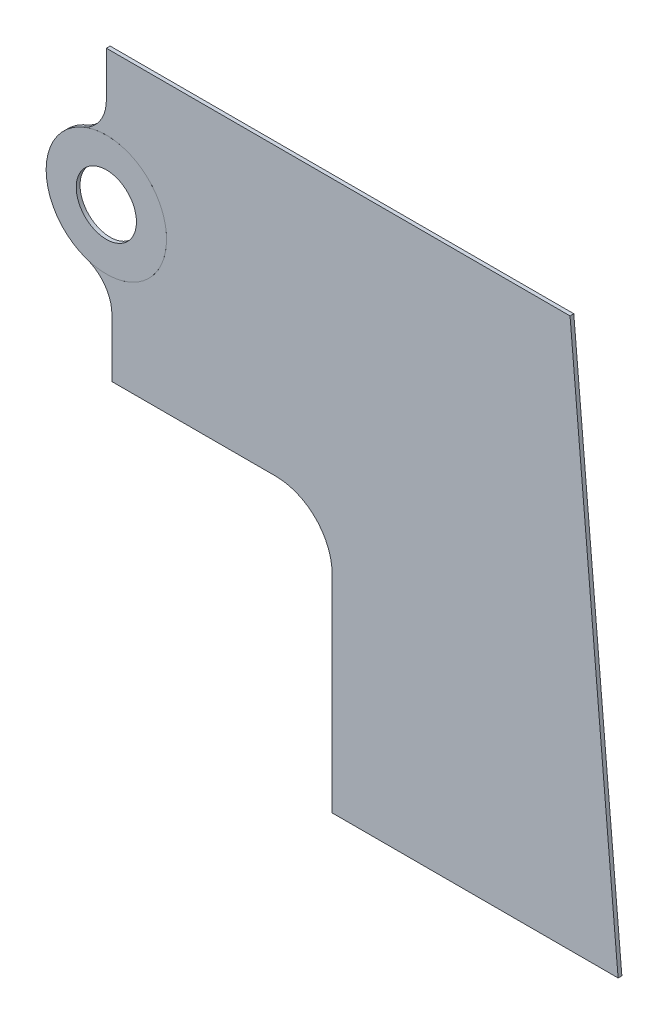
ISO-10303-21;
HEADER;
FILE_DESCRIPTION(('STEP AP214'),'2;1');
FILE_NAME('part.step','',(''),(''),'','','');
FILE_SCHEMA(('AUTOMOTIVE_DESIGN { 1 0 10303 214 1 1 1 1 }'));
ENDSEC;
DATA;
#1=APPLICATION_CONTEXT('core data for automotive mechanical design processes');
#2=APPLICATION_PROTOCOL_DEFINITION('international standard','automotive_design',2000,#1);
#3=PRODUCT_CONTEXT('',#1,'mechanical');
#4=PRODUCT('Part','Part','',(#3));
#5=PRODUCT_RELATED_PRODUCT_CATEGORY('part','',(#4));
#6=PRODUCT_DEFINITION_FORMATION('','',#4);
#7=PRODUCT_DEFINITION_CONTEXT('part definition',#1,'design');
#8=PRODUCT_DEFINITION('design','',#6,#7);
#9=PRODUCT_DEFINITION_SHAPE('','',#8);
#10=(LENGTH_UNIT() NAMED_UNIT(*) SI_UNIT(.MILLI.,.METRE.));
#11=(NAMED_UNIT(*) PLANE_ANGLE_UNIT() SI_UNIT($,.RADIAN.));
#12=(NAMED_UNIT(*) SI_UNIT($,.STERADIAN.) SOLID_ANGLE_UNIT());
#13=UNCERTAINTY_MEASURE_WITH_UNIT(LENGTH_MEASURE(1.E-05),#10,'distance_accuracy_value','');
#14=(GEOMETRIC_REPRESENTATION_CONTEXT(3) GLOBAL_UNCERTAINTY_ASSIGNED_CONTEXT((#13)) GLOBAL_UNIT_ASSIGNED_CONTEXT((#10,
#11,#12)) REPRESENTATION_CONTEXT('',''));
#15=CARTESIAN_POINT('',(0.,0.,0.));
#16=DIRECTION('',(0.,0.,1.));
#17=DIRECTION('',(1.,0.,0.));
#18=AXIS2_PLACEMENT_3D('',#15,#16,#17);
#19=CARTESIAN_POINT('',(-60.,109.995097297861,-0.01));
#20=DIRECTION('',(0.,0.,1.));
#21=DIRECTION('',(1.,0.,0.));
#22=AXIS2_PLACEMENT_3D('',#19,#20,#21);
#23=CYLINDRICAL_SURFACE('',#22,16.);
#24=CARTESIAN_POINT('',(-60.,109.995097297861,0.));
#25=DIRECTION('',(0.,0.,1.));
#26=DIRECTION('',(-1.,0.,0.));
#27=AXIS2_PLACEMENT_3D('',#24,#25,#26);
#28=CIRCLE('',#27,16.);
#29=CARTESIAN_POINT('',(-76.,109.995097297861,0.));
#30=VERTEX_POINT('',#29);
#31=EDGE_CURVE('E63',#30,#30,#28,.T.);
#32=ORIENTED_EDGE('',*,*,#31,.T.);
#33=EDGE_LOOP('',(#32));
#34=FACE_BOUND('',#33,.T.);
#35=CARTESIAN_POINT('',(-60.,109.995097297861,1.));
#36=DIRECTION('',(0.,0.,1.));
#37=DIRECTION('',(-1.,0.,0.));
#38=AXIS2_PLACEMENT_3D('',#35,#36,#37);
#39=CIRCLE('',#38,16.);
#40=CARTESIAN_POINT('',(-76.,109.995097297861,1.));
#41=VERTEX_POINT('',#40);
#42=EDGE_CURVE('E65',#41,#41,#39,.T.);
#43=ORIENTED_EDGE('',*,*,#42,.F.);
#44=EDGE_LOOP('',(#43));
#45=FACE_BOUND('',#44,.T.);
#46=ADVANCED_FACE('F52',(#34,#45),#23,.T.);
#47=CARTESIAN_POINT('',(-15.,55.,1.));
#48=DIRECTION('',(0.,0.,-1.));
#49=DIRECTION('',(-1.,0.,0.));
#50=AXIS2_PLACEMENT_3D('',#47,#48,#49);
#51=PLANE('',#50);
#52=CARTESIAN_POINT('',(-60.,109.995097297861,1.));
#53=DIRECTION('',(0.,0.,1.));
#54=DIRECTION('',(1.,0.,0.));
#55=AXIS2_PLACEMENT_3D('',#52,#53,#54);
#56=CIRCLE('',#55,8.);
#57=CARTESIAN_POINT('',(-52.,109.995097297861,1.));
#58=VERTEX_POINT('',#57);
#59=EDGE_CURVE('E56',#58,#58,#56,.T.);
#60=ORIENTED_EDGE('',*,*,#59,.F.);
#61=EDGE_LOOP('',(#60));
#62=FACE_BOUND('',#61,.T.);
#63=ORIENTED_EDGE('',*,*,#42,.T.);
#64=EDGE_LOOP('',(#63));
#65=FACE_BOUND('',#64,.T.);
#66=ADVANCED_FACE('F75',(#62,#65),#51,.F.);
#67=CARTESIAN_POINT('',(-15.,55.,0.));
#68=DIRECTION('',(0.,0.,-1.));
#69=DIRECTION('',(-1.,0.,0.));
#70=AXIS2_PLACEMENT_3D('',#67,#68,#69);
#71=PLANE('',#70);
#72=CARTESIAN_POINT('',(-60.,109.995097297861,0.));
#73=DIRECTION('',(0.,0.,1.));
#74=DIRECTION('',(1.,0.,0.));
#75=AXIS2_PLACEMENT_3D('',#72,#73,#74);
#76=CIRCLE('',#75,8.);
#77=CARTESIAN_POINT('',(-52.,109.995097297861,0.));
#78=VERTEX_POINT('',#77);
#79=EDGE_CURVE('E11',#78,#78,#76,.T.);
#80=ORIENTED_EDGE('',*,*,#79,.T.);
#81=EDGE_LOOP('',(#80));
#82=FACE_BOUND('',#81,.T.);
#83=ORIENTED_EDGE('',*,*,#31,.F.);
#84=EDGE_LOOP('',(#83));
#85=FACE_BOUND('',#84,.T.);
#86=ADVANCED_FACE('F54',(#82,#85),#71,.T.);
#87=CARTESIAN_POINT('',(-60.,109.995097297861,1.));
#88=DIRECTION('',(0.,0.,-1.));
#89=DIRECTION('',(-1.,0.,0.));
#90=AXIS2_PLACEMENT_3D('',#87,#88,#89);
#91=CYLINDRICAL_SURFACE('',#90,8.);
#92=ORIENTED_EDGE('',*,*,#59,.T.);
#93=EDGE_LOOP('',(#92));
#94=FACE_BOUND('',#93,.T.);
#95=ORIENTED_EDGE('',*,*,#79,.F.);
#96=EDGE_LOOP('',(#95));
#97=FACE_BOUND('',#96,.T.);
#98=ADVANCED_FACE('F74',(#94,#97),#91,.F.);
#99=CLOSED_SHELL('',(#46,#66,#86,#98));
#100=MANIFOLD_SOLID_BREP('B2',#99);
#101=CARTESIAN_POINT('',(-60.,109.995097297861,-0.01));
#102=DIRECTION('',(0.,0.,1.));
#103=DIRECTION('',(1.,0.,0.));
#104=AXIS2_PLACEMENT_3D('',#101,#102,#103);
#105=CYLINDRICAL_SURFACE('',#104,16.);
#106=CARTESIAN_POINT('',(-60.,109.995097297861,0.));
#107=DIRECTION('',(0.,0.,-1.));
#108=DIRECTION('',(-1.,0.,0.));
#109=AXIS2_PLACEMENT_3D('',#106,#107,#108);
#110=CIRCLE('',#109,16.);
#111=CARTESIAN_POINT('',(-66.1538461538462,124.764328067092,0.));
#112=VERTEX_POINT('',#111);
#113=CARTESIAN_POINT('',(-65.2447067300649,94.8791106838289,0.));
#114=VERTEX_POINT('',#113);
#115=EDGE_CURVE('E121',#112,#114,#110,.T.);
#116=ORIENTED_EDGE('',*,*,#115,.T.);
#117=DIRECTION('',(0.,0.,-1.));
#118=VECTOR('',#117,1.);
#119=CARTESIAN_POINT('',(-65.2447067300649,94.8791106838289,1.));
#120=LINE('',#119,#118);
#121=CARTESIAN_POINT('',(-65.2447067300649,94.8791106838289,1.));
#122=VERTEX_POINT('',#121);
#123=EDGE_CURVE('E234',#122,#114,#120,.T.);
#124=ORIENTED_EDGE('',*,*,#123,.F.);
#125=CARTESIAN_POINT('',(-60.,109.995097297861,1.));
#126=DIRECTION('',(0.,0.,-1.));
#127=DIRECTION('',(-1.,0.,0.));
#128=AXIS2_PLACEMENT_3D('',#125,#126,#127);
#129=CIRCLE('',#128,16.);
#130=CARTESIAN_POINT('',(-66.1538461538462,124.764328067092,1.));
#131=VERTEX_POINT('',#130);
#132=EDGE_CURVE('E225',#131,#122,#129,.T.);
#133=ORIENTED_EDGE('',*,*,#132,.F.);
#134=DIRECTION('',(0.,0.,-1.));
#135=VECTOR('',#134,1.);
#136=CARTESIAN_POINT('',(-66.1538461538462,124.764328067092,1.));
#137=LINE('',#136,#135);
#138=EDGE_CURVE('E50',#131,#112,#137,.T.);
#139=ORIENTED_EDGE('',*,*,#138,.T.);
#140=EDGE_LOOP('',(#116,#124,#133,#139));
#141=FACE_BOUND('',#140,.T.);
#142=ADVANCED_FACE('F118',(#141),#105,.F.);
#143=CARTESIAN_POINT('',(-58.5226484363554,70.,1.));
#144=DIRECTION('',(0.,1.,0.));
#145=DIRECTION('',(0.,0.,1.));
#146=AXIS2_PLACEMENT_3D('',#143,#144,#145);
#147=PLANE('',#146);
#148=DIRECTION('',(1.,0.,0.));
#149=VECTOR('',#148,1.);
#150=CARTESIAN_POINT('',(-58.5226484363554,70.,0.));
#151=LINE('',#150,#149);
#152=CARTESIAN_POINT('',(-58.5226484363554,70.,0.));
#153=VERTEX_POINT('',#152);
#154=CARTESIAN_POINT('',(-15.,70.,0.));
#155=VERTEX_POINT('',#154);
#156=EDGE_CURVE('E254',#153,#155,#151,.T.);
#157=ORIENTED_EDGE('',*,*,#156,.T.);
#158=DIRECTION('',(0.,0.,-1.));
#159=VECTOR('',#158,1.);
#160=CARTESIAN_POINT('',(-15.,70.,1.));
#161=LINE('',#160,#159);
#162=CARTESIAN_POINT('',(-15.,70.,1.));
#163=VERTEX_POINT('',#162);
#164=EDGE_CURVE('E243',#163,#155,#161,.T.);
#165=ORIENTED_EDGE('',*,*,#164,.F.);
#166=DIRECTION('',(1.,0.,0.));
#167=VECTOR('',#166,1.);
#168=CARTESIAN_POINT('',(-58.5226484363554,70.,1.));
#169=LINE('',#168,#167);
#170=CARTESIAN_POINT('',(-58.5226484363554,70.,1.));
#171=VERTEX_POINT('',#170);
#172=EDGE_CURVE('E273',#171,#163,#169,.T.);
#173=ORIENTED_EDGE('',*,*,#172,.F.);
#174=DIRECTION('',(0.,0.,-1.));
#175=VECTOR('',#174,1.);
#176=CARTESIAN_POINT('',(-58.5226484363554,70.,1.));
#177=LINE('',#176,#175);
#178=EDGE_CURVE('E240',#171,#153,#177,.T.);
#179=ORIENTED_EDGE('',*,*,#178,.T.);
#180=EDGE_LOOP('',(#157,#165,#173,#179));
#181=FACE_BOUND('',#180,.T.);
#182=ADVANCED_FACE('F312',(#181),#147,.F.);
#183=CARTESIAN_POINT('',(-15.,55.,1.));
#184=DIRECTION('',(0.,0.,-1.));
#185=DIRECTION('',(-1.,0.,0.));
#186=AXIS2_PLACEMENT_3D('',#183,#184,#185);
#187=CYLINDRICAL_SURFACE('',#186,15.);
#188=CARTESIAN_POINT('',(-15.,55.,0.));
#189=DIRECTION('',(0.,0.,-1.));
#190=DIRECTION('',(-1.,0.,0.));
#191=AXIS2_PLACEMENT_3D('',#188,#189,#190);
#192=CIRCLE('',#191,15.);
#193=CARTESIAN_POINT('',(0.,55.,0.));
#194=VERTEX_POINT('',#193);
#195=EDGE_CURVE('E252',#155,#194,#192,.T.);
#196=ORIENTED_EDGE('',*,*,#195,.T.);
#197=DIRECTION('',(0.,0.,-1.));
#198=VECTOR('',#197,1.);
#199=CARTESIAN_POINT('',(0.,55.,1.));
#200=LINE('',#199,#198);
#201=CARTESIAN_POINT('',(0.,55.,1.));
#202=VERTEX_POINT('',#201);
#203=EDGE_CURVE('E246',#202,#194,#200,.T.);
#204=ORIENTED_EDGE('',*,*,#203,.F.);
#205=CARTESIAN_POINT('',(-15.,55.,1.));
#206=DIRECTION('',(0.,0.,-1.));
#207=DIRECTION('',(-1.,0.,0.));
#208=AXIS2_PLACEMENT_3D('',#205,#206,#207);
#209=CIRCLE('',#208,15.);
#210=EDGE_CURVE('E271',#163,#202,#209,.T.);
#211=ORIENTED_EDGE('',*,*,#210,.F.);
#212=ORIENTED_EDGE('',*,*,#164,.T.);
#213=EDGE_LOOP('',(#196,#204,#211,#212));
#214=FACE_BOUND('',#213,.T.);
#215=ADVANCED_FACE('F316',(#214),#187,.F.);
#216=CARTESIAN_POINT('',(0.,0.,1.));
#217=DIRECTION('',(1.,0.,0.));
#218=DIRECTION('',(0.,0.,-1.));
#219=AXIS2_PLACEMENT_3D('',#216,#217,#218);
#220=PLANE('',#219);
#221=DIRECTION('',(0.,-1.,0.));
#222=VECTOR('',#221,1.);
#223=CARTESIAN_POINT('',(0.,0.,0.));
#224=LINE('',#223,#222);
#225=CARTESIAN_POINT('',(0.,0.,0.));
#226=VERTEX_POINT('',#225);
#227=EDGE_CURVE('E220',#194,#226,#224,.T.);
#228=ORIENTED_EDGE('',*,*,#227,.T.);
#229=DIRECTION('',(0.,0.,-1.));
#230=VECTOR('',#229,1.);
#231=CARTESIAN_POINT('',(0.,0.,1.));
#232=LINE('',#231,#230);
#233=CARTESIAN_POINT('',(0.,0.,1.));
#234=VERTEX_POINT('',#233);
#235=EDGE_CURVE('E249',#234,#226,#232,.T.);
#236=ORIENTED_EDGE('',*,*,#235,.F.);
#237=DIRECTION('',(0.,-1.,0.));
#238=VECTOR('',#237,1.);
#239=CARTESIAN_POINT('',(0.,0.,1.));
#240=LINE('',#239,#238);
#241=EDGE_CURVE('E216',#202,#234,#240,.T.);
#242=ORIENTED_EDGE('',*,*,#241,.F.);
#243=ORIENTED_EDGE('',*,*,#203,.T.);
#244=EDGE_LOOP('',(#228,#236,#242,#243));
#245=FACE_BOUND('',#244,.T.);
#246=ADVANCED_FACE('F319',(#245),#220,.F.);
#247=CARTESIAN_POINT('',(76.,0.,1.));
#248=DIRECTION('',(0.,1.,0.));
#249=DIRECTION('',(-1.,0.,0.));
#250=AXIS2_PLACEMENT_3D('',#247,#248,#249);
#251=PLANE('',#250);
#252=DIRECTION('',(1.,0.,0.));
#253=VECTOR('',#252,1.);
#254=CARTESIAN_POINT('',(76.,0.,0.));
#255=LINE('',#254,#253);
#256=CARTESIAN_POINT('',(76.,0.,0.));
#257=VERTEX_POINT('',#256);
#258=EDGE_CURVE('E224',#226,#257,#255,.T.);
#259=ORIENTED_EDGE('',*,*,#258,.T.);
#260=DIRECTION('',(0.,0.,-1.));
#261=VECTOR('',#260,1.);
#262=CARTESIAN_POINT('',(76.,0.,1.));
#263=LINE('',#262,#261);
#264=CARTESIAN_POINT('',(76.,0.,1.));
#265=VERTEX_POINT('',#264);
#266=EDGE_CURVE('E203',#265,#257,#263,.T.);
#267=ORIENTED_EDGE('',*,*,#266,.F.);
#268=DIRECTION('',(1.,0.,0.));
#269=VECTOR('',#268,1.);
#270=CARTESIAN_POINT('',(76.,0.,1.));
#271=LINE('',#270,#269);
#272=EDGE_CURVE('E210',#234,#265,#271,.T.);
#273=ORIENTED_EDGE('',*,*,#272,.F.);
#274=ORIENTED_EDGE('',*,*,#235,.T.);
#275=EDGE_LOOP('',(#259,#267,#273,#274));
#276=FACE_BOUND('',#275,.T.);
#277=ADVANCED_FACE('F222',(#276),#251,.F.);
#278=CARTESIAN_POINT('',(76.,0.,1.));
#279=DIRECTION('',(-0.996194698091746,-0.087155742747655,0.));
#280=DIRECTION('',(0.087155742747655,-0.996194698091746,0.));
#281=AXIS2_PLACEMENT_3D('',#278,#279,#280);
#282=PLANE('',#281);
#283=DIRECTION('',(-0.087155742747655,0.996194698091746,0.));
#284=VECTOR('',#283,1.);
#285=CARTESIAN_POINT('',(76.,0.,0.));
#286=LINE('',#285,#284);
#287=CARTESIAN_POINT('',(63.2270840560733,145.995097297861,0.));
#288=VERTEX_POINT('',#287);
#289=EDGE_CURVE('E267',#257,#288,#286,.T.);
#290=ORIENTED_EDGE('',*,*,#289,.T.);
#291=DIRECTION('',(0.,0.,-1.));
#292=VECTOR('',#291,1.);
#293=CARTESIAN_POINT('',(63.2270840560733,145.995097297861,1.));
#294=LINE('',#293,#292);
#295=CARTESIAN_POINT('',(63.2270840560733,145.995097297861,1.));
#296=VERTEX_POINT('',#295);
#297=EDGE_CURVE('E206',#296,#288,#294,.T.);
#298=ORIENTED_EDGE('',*,*,#297,.F.);
#299=DIRECTION('',(-0.087155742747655,0.996194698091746,0.));
#300=VECTOR('',#299,1.);
#301=CARTESIAN_POINT('',(76.,0.,1.));
#302=LINE('',#301,#300);
#303=EDGE_CURVE('E199',#265,#296,#302,.T.);
#304=ORIENTED_EDGE('',*,*,#303,.F.);
#305=ORIENTED_EDGE('',*,*,#266,.T.);
#306=EDGE_LOOP('',(#290,#298,#304,#305));
#307=FACE_BOUND('',#306,.T.);
#308=ADVANCED_FACE('F201',(#307),#282,.F.);
#309=CARTESIAN_POINT('',(-60.,145.995097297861,1.));
#310=DIRECTION('',(0.,-1.,0.));
#311=DIRECTION('',(0.,0.,-1.));
#312=AXIS2_PLACEMENT_3D('',#309,#310,#311);
#313=PLANE('',#312);
#314=DIRECTION('',(-1.,0.,0.));
#315=VECTOR('',#314,1.);
#316=CARTESIAN_POINT('',(-60.,145.995097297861,0.));
#317=LINE('',#316,#315);
#318=CARTESIAN_POINT('',(-60.,145.995097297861,0.));
#319=VERTEX_POINT('',#318);
#320=EDGE_CURVE('E264',#288,#319,#317,.T.);
#321=ORIENTED_EDGE('',*,*,#320,.T.);
#322=DIRECTION('',(0.,0.,-1.));
#323=VECTOR('',#322,1.);
#324=CARTESIAN_POINT('',(-60.,145.995097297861,1.));
#325=LINE('',#324,#323);
#326=CARTESIAN_POINT('',(-60.,145.995097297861,1.));
#327=VERTEX_POINT('',#326);
#328=EDGE_CURVE('E227',#327,#319,#325,.T.);
#329=ORIENTED_EDGE('',*,*,#328,.F.);
#330=DIRECTION('',(-1.,0.,0.));
#331=VECTOR('',#330,1.);
#332=CARTESIAN_POINT('',(-60.,145.995097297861,1.));
#333=LINE('',#332,#331);
#334=EDGE_CURVE('E209',#296,#327,#333,.T.);
#335=ORIENTED_EDGE('',*,*,#334,.F.);
#336=ORIENTED_EDGE('',*,*,#297,.T.);
#337=EDGE_LOOP('',(#321,#329,#335,#336));
#338=FACE_BOUND('',#337,.T.);
#339=ADVANCED_FACE('F289',(#338),#313,.F.);
#340=CARTESIAN_POINT('',(-60.,133.995097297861,1.));
#341=DIRECTION('',(1.,0.,0.));
#342=DIRECTION('',(0.,1.,0.));
#343=AXIS2_PLACEMENT_3D('',#340,#341,#342);
#344=PLANE('',#343);
#345=DIRECTION('',(0.,-1.,0.));
#346=VECTOR('',#345,1.);
#347=CARTESIAN_POINT('',(-60.,133.995097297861,0.));
#348=LINE('',#347,#346);
#349=CARTESIAN_POINT('',(-60.,133.995097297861,0.));
#350=VERTEX_POINT('',#349);
#351=EDGE_CURVE('E262',#319,#350,#348,.T.);
#352=ORIENTED_EDGE('',*,*,#351,.T.);
#353=DIRECTION('',(0.,0.,-1.));
#354=VECTOR('',#353,1.);
#355=CARTESIAN_POINT('',(-60.,133.995097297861,1.));
#356=LINE('',#355,#354);
#357=CARTESIAN_POINT('',(-60.,133.995097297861,1.));
#358=VERTEX_POINT('',#357);
#359=EDGE_CURVE('E232',#358,#350,#356,.T.);
#360=ORIENTED_EDGE('',*,*,#359,.F.);
#361=DIRECTION('',(0.,-1.,0.));
#362=VECTOR('',#361,1.);
#363=CARTESIAN_POINT('',(-60.,133.995097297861,1.));
#364=LINE('',#363,#362);
#365=EDGE_CURVE('E282',#327,#358,#364,.T.);
#366=ORIENTED_EDGE('',*,*,#365,.F.);
#367=ORIENTED_EDGE('',*,*,#328,.T.);
#368=EDGE_LOOP('',(#352,#360,#366,#367));
#369=FACE_BOUND('',#368,.T.);
#370=ADVANCED_FACE('F293',(#369),#344,.F.);
#371=CARTESIAN_POINT('',(-15.,55.,1.));
#372=DIRECTION('',(0.,0.,-1.));
#373=DIRECTION('',(-1.,0.,0.));
#374=AXIS2_PLACEMENT_3D('',#371,#372,#373);
#375=PLANE('',#374);
#376=CARTESIAN_POINT('',(-70.,133.995097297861,1.));
#377=DIRECTION('',(0.,0.,-1.));
#378=DIRECTION('',(-1.,0.,0.));
#379=AXIS2_PLACEMENT_3D('',#376,#377,#378);
#380=CIRCLE('',#379,9.99999999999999);
#381=EDGE_CURVE('E280',#358,#131,#380,.T.);
#382=ORIENTED_EDGE('',*,*,#381,.T.);
#383=ORIENTED_EDGE('',*,*,#132,.T.);
#384=CARTESIAN_POINT('',(-68.5226484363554,85.4316190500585,1.));
#385=DIRECTION('',(0.,0.,-1.));
#386=DIRECTION('',(-1.,0.,0.));
#387=AXIS2_PLACEMENT_3D('',#384,#385,#386);
#388=CIRCLE('',#387,9.99999999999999);
#389=CARTESIAN_POINT('',(-58.5226484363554,85.4316190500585,1.));
#390=VERTEX_POINT('',#389);
#391=EDGE_CURVE('E278',#122,#390,#388,.T.);
#392=ORIENTED_EDGE('',*,*,#391,.T.);
#393=DIRECTION('',(0.,-1.,0.));
#394=VECTOR('',#393,1.);
#395=CARTESIAN_POINT('',(-58.5226484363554,85.4316190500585,1.));
#396=LINE('',#395,#394);
#397=EDGE_CURVE('E274',#390,#171,#396,.T.);
#398=ORIENTED_EDGE('',*,*,#397,.T.);
#399=ORIENTED_EDGE('',*,*,#172,.T.);
#400=ORIENTED_EDGE('',*,*,#210,.T.);
#401=ORIENTED_EDGE('',*,*,#241,.T.);
#402=ORIENTED_EDGE('',*,*,#272,.T.);
#403=ORIENTED_EDGE('',*,*,#303,.T.);
#404=ORIENTED_EDGE('',*,*,#334,.T.);
#405=ORIENTED_EDGE('',*,*,#365,.T.);
#406=EDGE_LOOP('',(#382,#383,#392,#398,#399,#400,#401,#402,#403,#404,#405));
#407=FACE_BOUND('',#406,.T.);
#408=ADVANCED_FACE('F214',(#407),#375,.F.);
#409=CARTESIAN_POINT('',(-58.5226484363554,85.4316190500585,1.));
#410=DIRECTION('',(1.,0.,0.));
#411=DIRECTION('',(0.,1.,0.));
#412=AXIS2_PLACEMENT_3D('',#409,#410,#411);
#413=PLANE('',#412);
#414=DIRECTION('',(0.,-1.,0.));
#415=VECTOR('',#414,1.);
#416=CARTESIAN_POINT('',(-58.5226484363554,85.4316190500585,0.));
#417=LINE('',#416,#415);
#418=CARTESIAN_POINT('',(-58.5226484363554,85.4316190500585,0.));
#419=VERTEX_POINT('',#418);
#420=EDGE_CURVE('E256',#419,#153,#417,.T.);
#421=ORIENTED_EDGE('',*,*,#420,.T.);
#422=ORIENTED_EDGE('',*,*,#178,.F.);
#423=ORIENTED_EDGE('',*,*,#397,.F.);
#424=DIRECTION('',(0.,0.,-1.));
#425=VECTOR('',#424,1.);
#426=CARTESIAN_POINT('',(-58.5226484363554,85.4316190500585,1.));
#427=LINE('',#426,#425);
#428=EDGE_CURVE('E237',#390,#419,#427,.T.);
#429=ORIENTED_EDGE('',*,*,#428,.T.);
#430=EDGE_LOOP('',(#421,#422,#423,#429));
#431=FACE_BOUND('',#430,.T.);
#432=ADVANCED_FACE('F306',(#431),#413,.F.);
#433=CARTESIAN_POINT('',(-15.,55.,0.));
#434=DIRECTION('',(0.,0.,-1.));
#435=DIRECTION('',(-1.,0.,0.));
#436=AXIS2_PLACEMENT_3D('',#433,#434,#435);
#437=PLANE('',#436);
#438=ORIENTED_EDGE('',*,*,#115,.F.);
#439=CARTESIAN_POINT('',(-70.,133.995097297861,0.));
#440=DIRECTION('',(0.,0.,-1.));
#441=DIRECTION('',(-1.,0.,0.));
#442=AXIS2_PLACEMENT_3D('',#439,#440,#441);
#443=CIRCLE('',#442,9.99999999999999);
#444=EDGE_CURVE('E260',#350,#112,#443,.T.);
#445=ORIENTED_EDGE('',*,*,#444,.F.);
#446=ORIENTED_EDGE('',*,*,#351,.F.);
#447=ORIENTED_EDGE('',*,*,#320,.F.);
#448=ORIENTED_EDGE('',*,*,#289,.F.);
#449=ORIENTED_EDGE('',*,*,#258,.F.);
#450=ORIENTED_EDGE('',*,*,#227,.F.);
#451=ORIENTED_EDGE('',*,*,#195,.F.);
#452=ORIENTED_EDGE('',*,*,#156,.F.);
#453=ORIENTED_EDGE('',*,*,#420,.F.);
#454=CARTESIAN_POINT('',(-68.5226484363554,85.4316190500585,0.));
#455=DIRECTION('',(0.,0.,-1.));
#456=DIRECTION('',(-1.,0.,0.));
#457=AXIS2_PLACEMENT_3D('',#454,#455,#456);
#458=CIRCLE('',#457,9.99999999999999);
#459=EDGE_CURVE('E258',#114,#419,#458,.T.);
#460=ORIENTED_EDGE('',*,*,#459,.F.);
#461=EDGE_LOOP('',(#438,#445,#446,#447,#448,#449,#450,#451,#452,#453,#460));
#462=FACE_BOUND('',#461,.T.);
#463=ADVANCED_FACE('F321',(#462),#437,.T.);
#464=CARTESIAN_POINT('',(-68.5226484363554,85.4316190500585,1.));
#465=DIRECTION('',(0.,0.,-1.));
#466=DIRECTION('',(-1.,0.,0.));
#467=AXIS2_PLACEMENT_3D('',#464,#465,#466);
#468=CYLINDRICAL_SURFACE('',#467,9.99999999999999);
#469=ORIENTED_EDGE('',*,*,#459,.T.);
#470=ORIENTED_EDGE('',*,*,#428,.F.);
#471=ORIENTED_EDGE('',*,*,#391,.F.);
#472=ORIENTED_EDGE('',*,*,#123,.T.);
#473=EDGE_LOOP('',(#469,#470,#471,#472));
#474=FACE_BOUND('',#473,.T.);
#475=ADVANCED_FACE('F301',(#474),#468,.F.);
#476=CARTESIAN_POINT('',(-70.,133.995097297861,1.));
#477=DIRECTION('',(0.,0.,-1.));
#478=DIRECTION('',(-1.,0.,0.));
#479=AXIS2_PLACEMENT_3D('',#476,#477,#478);
#480=CYLINDRICAL_SURFACE('',#479,9.99999999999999);
#481=ORIENTED_EDGE('',*,*,#444,.T.);
#482=ORIENTED_EDGE('',*,*,#138,.F.);
#483=ORIENTED_EDGE('',*,*,#381,.F.);
#484=ORIENTED_EDGE('',*,*,#359,.T.);
#485=EDGE_LOOP('',(#481,#482,#483,#484));
#486=FACE_BOUND('',#485,.T.);
#487=ADVANCED_FACE('F295',(#486),#480,.F.);
#488=CLOSED_SHELL('',(#142,#182,#215,#246,#277,#308,#339,#370,#408,#432,#463,#475,#487));
#489=MANIFOLD_SOLID_BREP('B6',#488);
#490=ADVANCED_BREP_SHAPE_REPRESENTATION('',(#18,#100,#489),#14);
#491=SHAPE_DEFINITION_REPRESENTATION(#9,#490);
ENDSEC;
END-ISO-10303-21;
